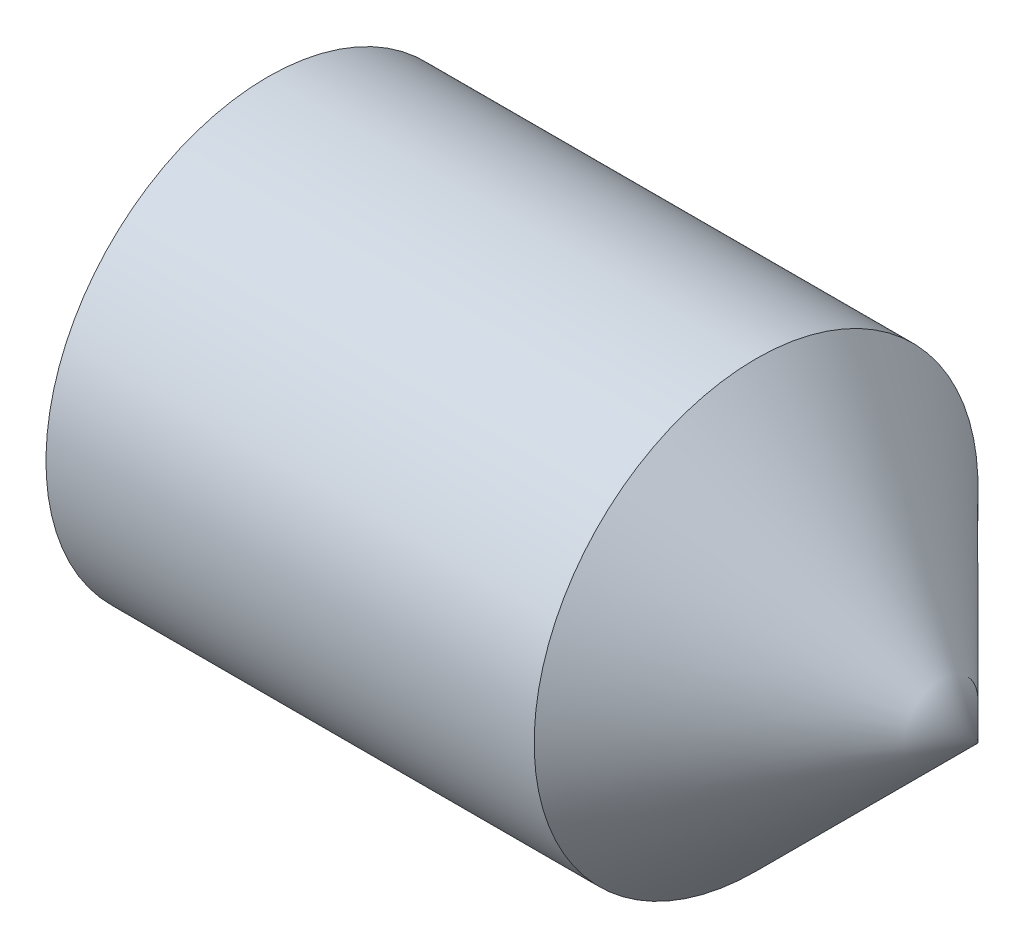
from build123d import *

# Parameters (mm, degrees)
CUT_EXTRUDE1_DEPTH = 3.9624


with BuildPart() as part:
    # Sketch1 → Revolve3 (revolve)
    with BuildSketch(Plane.XY):
        Polygon((0, 3.96875), (8.73125, 3.96875), (12.7, 0), (0, 0), align=None)
    revolve(axis=Axis((12.7, 0, 0), (-1, 0, 0)))

    # Sketch2 → Cut-Extrude1 (cut)
    with BuildSketch(Plane.ZY):
        Polygon((2.211733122, -0.584614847), (1.612157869, 1.623109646), (-0.599575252, 2.207724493), (-2.211733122, 0.584614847), (-1.612157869, -1.623109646), (0.599575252, -2.207724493), align=None)
    extrude(amount=-CUT_EXTRUDE1_DEPTH, mode=Mode.SUBTRACT)


solid = part.part
